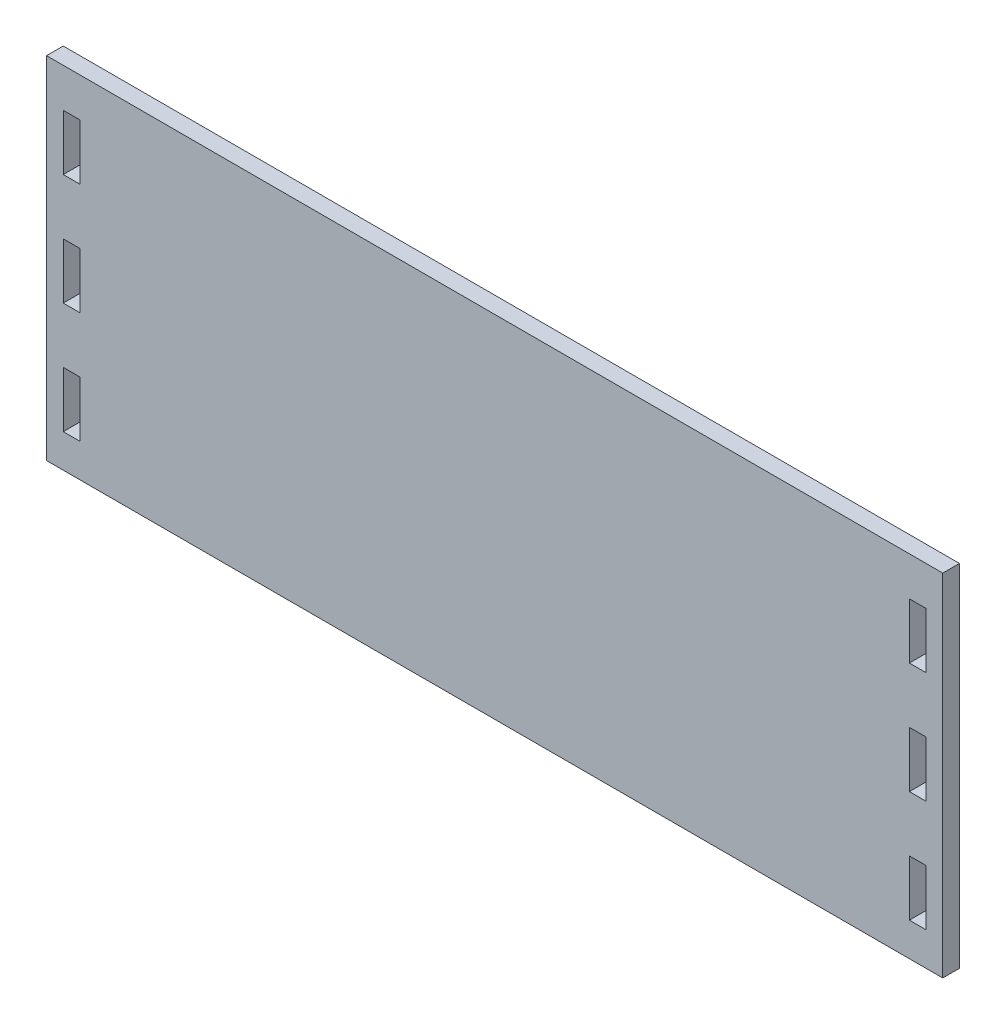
from build123d import *

# Parameters (mm, degrees)
SKETCH1_W           = 161
SKETCH1_H           = 63
SKETCH1_W_2         = 3
SKETCH1_H_2         = 10
BOSS_EXTRUDE1_DEPTH = 3


with BuildPart() as part:
    # Sketch1 → Boss-Extrude1 (new body)
    with BuildSketch(Plane.XY):
        Rectangle(SKETCH1_W, SKETCH1_H)
        with Locations((76, -0.5)):
            Rectangle(SKETCH1_W_2, SKETCH1_H_2, mode=Mode.SUBTRACT)
        with Locations((76, -20.5)):
            Rectangle(SKETCH1_W_2, SKETCH1_H_2, mode=Mode.SUBTRACT)
        with Locations((76, 19.5)):
            Rectangle(SKETCH1_W_2, SKETCH1_H_2, mode=Mode.SUBTRACT)
        with Locations((-76, -0.5)):
            Rectangle(SKETCH1_W_2, SKETCH1_H_2, mode=Mode.SUBTRACT)
        with Locations((-76, -20.5)):
            Rectangle(SKETCH1_W_2, SKETCH1_H_2, mode=Mode.SUBTRACT)
        with Locations((-76, 19.5)):
            Rectangle(SKETCH1_W_2, SKETCH1_H_2, mode=Mode.SUBTRACT)
    extrude(amount=BOSS_EXTRUDE1_DEPTH)


solid = part.part
